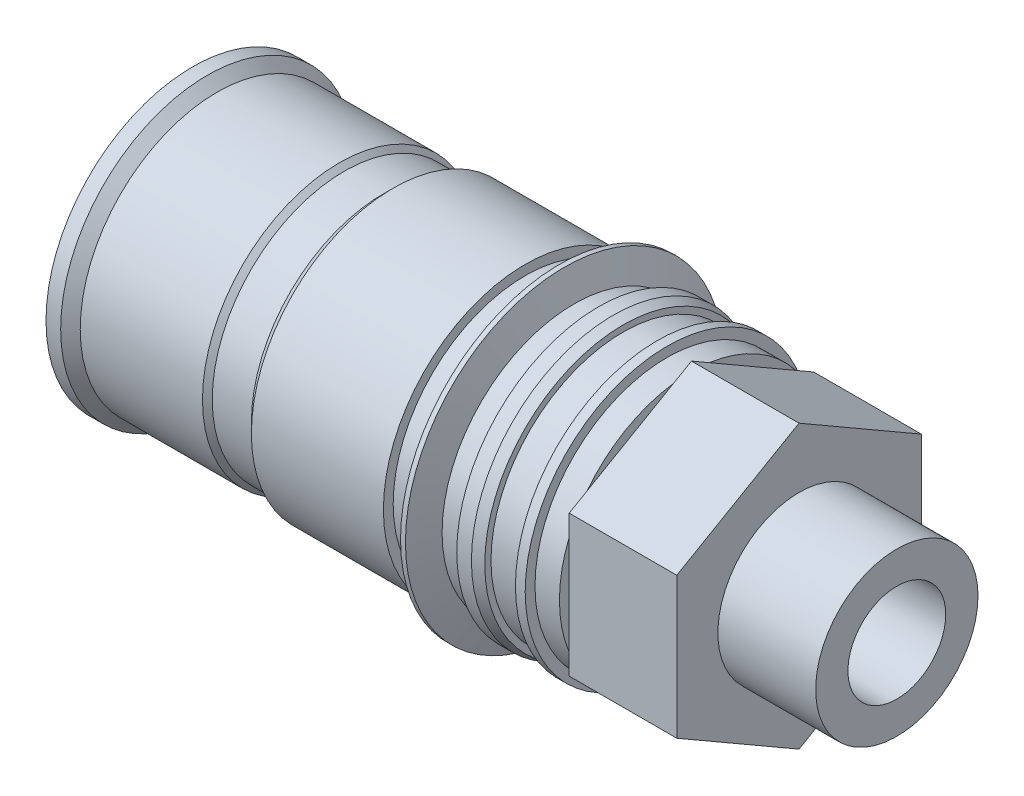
from build123d import *

# Parameters (mm, degrees)
SALIENTE_EXTRUIR1_DEPTH = 22
CROQUIS3_R              = 16.6
SALIENTE_EXTRUIR2_DEPTH = 20
CROQUIS4_R              = 10
CORTAR_EXTRUIR1_DEPTH   = 152.155033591


with BuildPart() as part:
    # Croquis1 → Revoluci_n1 (revolve)
    with BuildSketch(Plane.XY, mode=Mode.PRIVATE) as revoluci_n1_sk:
        Polygon((0, 0), (0, 30), (3, 30), (5, 28), (30, 28), (31, 27), (39, 27), (41, 29), (68, 29), (68, 27), (73, 27), (75, 32.494954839), (76, 32.494954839), (78, 27), (83, 27), (83, 29), (86, 29), (88, 28.272059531), (88, 27), (95, 27), (95, 29), (97, 29), (97, 27), (102, 27), (102, 0), align=None)
    revolve(revoluci_n1_sk.sketch.rotate(Axis((0, 0, 0), (1, 0, 0)), 90), axis=Axis((0, 0, 0), (1, 0, 0)))

    # Croquis2 → Saliente-Extruir1 (add)
    with BuildSketch(Plane(origin=(102, 0, 0), x_dir=(0, 0, -1), z_dir=(1, 0, 0))):
        Polygon((0, 28.867513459), (-25, 14.43375673), (-25, -14.43375673), (0, -28.867513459), (25, -14.43375673), (25, 14.43375673), align=None)
    extrude(amount=SALIENTE_EXTRUIR1_DEPTH)

    # Croquis3 → Saliente-Extruir2 (add)
    with BuildSketch(Plane(origin=(124, 0, 0), x_dir=(0, 0, -1), z_dir=(1, 0, 0))):
        Circle(CROQUIS3_R)
    extrude(amount=SALIENTE_EXTRUIR2_DEPTH)

    # Croquis4 → Cortar-Extruir1 (cut, through all)
    with BuildSketch(Plane(origin=(144, 0, 0), x_dir=(0, 0, -1), z_dir=(1, 0, 0))):
        Circle(CROQUIS4_R)
    extrude(amount=-CORTAR_EXTRUIR1_DEPTH, mode=Mode.SUBTRACT)


solid = part.part
